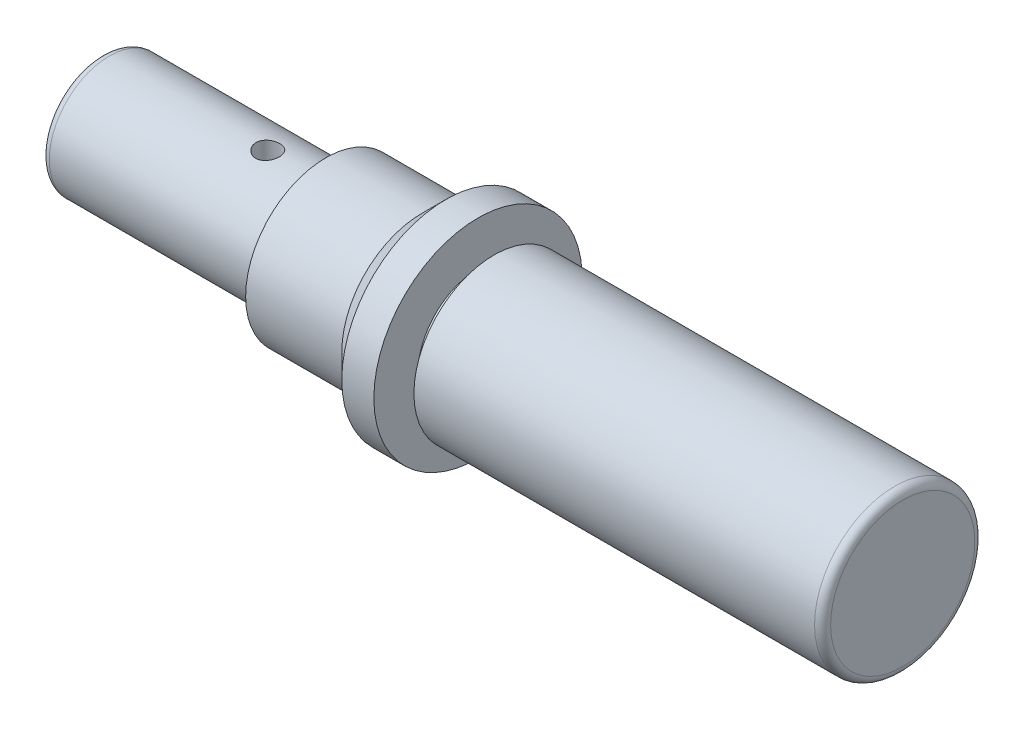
ISO-10303-21;
HEADER;
FILE_DESCRIPTION(('STEP AP214'),'2;1');
FILE_NAME('part.step','',(''),(''),'','','');
FILE_SCHEMA(('AUTOMOTIVE_DESIGN { 1 0 10303 214 1 1 1 1 }'));
ENDSEC;
DATA;
#1=APPLICATION_CONTEXT('core data for automotive mechanical design processes');
#2=APPLICATION_PROTOCOL_DEFINITION('international standard','automotive_design',2000,#1);
#3=PRODUCT_CONTEXT('',#1,'mechanical');
#4=PRODUCT('Part','Part','',(#3));
#5=PRODUCT_RELATED_PRODUCT_CATEGORY('part','',(#4));
#6=PRODUCT_DEFINITION_FORMATION('','',#4);
#7=PRODUCT_DEFINITION_CONTEXT('part definition',#1,'design');
#8=PRODUCT_DEFINITION('design','',#6,#7);
#9=PRODUCT_DEFINITION_SHAPE('','',#8);
#10=(LENGTH_UNIT() NAMED_UNIT(*) SI_UNIT(.MILLI.,.METRE.));
#11=(NAMED_UNIT(*) PLANE_ANGLE_UNIT() SI_UNIT($,.RADIAN.));
#12=(NAMED_UNIT(*) SI_UNIT($,.STERADIAN.) SOLID_ANGLE_UNIT());
#13=UNCERTAINTY_MEASURE_WITH_UNIT(LENGTH_MEASURE(1.E-05),#10,'distance_accuracy_value','');
#14=(GEOMETRIC_REPRESENTATION_CONTEXT(3) GLOBAL_UNCERTAINTY_ASSIGNED_CONTEXT((#13)) GLOBAL_UNIT_ASSIGNED_CONTEXT((#10,
#11,#12)) REPRESENTATION_CONTEXT('',''));
#15=CARTESIAN_POINT('',(0.,0.,0.));
#16=DIRECTION('',(0.,0.,1.));
#17=DIRECTION('',(1.,0.,0.));
#18=AXIS2_PLACEMENT_3D('',#15,#16,#17);
#19=CARTESIAN_POINT('',(-61.6997640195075,9.89779965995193,0.));
#20=DIRECTION('',(1.,0.,0.));
#21=DIRECTION('',(0.,0.,-1.));
#22=AXIS2_PLACEMENT_3D('',#19,#20,#21);
#23=PLANE('',#22);
#24=CARTESIAN_POINT('',(-61.6997640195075,9.89779965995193,0.));
#25=DIRECTION('',(1.,0.,0.));
#26=DIRECTION('',(0.,0.,-1.));
#27=AXIS2_PLACEMENT_3D('',#24,#25,#26);
#28=CIRCLE('',#27,6.5);
#29=CARTESIAN_POINT('',(-61.6997640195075,9.89779965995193,-6.5));
#30=VERTEX_POINT('',#29);
#31=EDGE_CURVE('E59',#30,#30,#28,.F.);
#32=ORIENTED_EDGE('',*,*,#31,.T.);
#33=EDGE_LOOP('',(#32));
#34=FACE_BOUND('',#33,.T.);
#35=ADVANCED_FACE('F40',(#34),#23,.F.);
#36=CARTESIAN_POINT('',(-61.6997640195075,9.89779965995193,0.));
#37=DIRECTION('',(-1.,0.,0.));
#38=DIRECTION('',(0.,0.,1.));
#39=AXIS2_PLACEMENT_3D('',#36,#37,#38);
#40=CYLINDRICAL_SURFACE('',#39,7.5);
#41=CARTESIAN_POINT('',(-40.6997640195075,2.50584884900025,1.26848855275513));
#42=CARTESIAN_POINT('',(-40.6164174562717,2.50584728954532,1.26848542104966));
#43=CARTESIAN_POINT('',(-40.5330320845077,2.50463505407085,1.26147673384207));
#44=CARTESIAN_POINT('',(-40.3686202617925,2.49994263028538,1.23365431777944));
#45=CARTESIAN_POINT('',(-40.2875957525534,2.49646062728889,1.21282954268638));
#46=CARTESIAN_POINT('',(-40.1303080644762,2.48769399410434,1.15805762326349));
#47=CARTESIAN_POINT('',(-40.0540402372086,2.48241115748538,1.12412353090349));
#48=CARTESIAN_POINT('',(-39.908251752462,2.47072894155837,1.04414865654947));
#49=CARTESIAN_POINT('',(-39.8387307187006,2.46432962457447,0.998108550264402));
#50=CARTESIAN_POINT('',(-39.7074225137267,2.45115462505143,0.894555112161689));
#51=CARTESIAN_POINT('',(-39.6457446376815,2.44437519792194,0.836903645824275));
#52=CARTESIAN_POINT('',(-39.532827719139,2.43141754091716,0.712086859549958));
#53=CARTESIAN_POINT('',(-39.4815894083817,2.42523935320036,0.644920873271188));
#54=CARTESIAN_POINT('',(-39.3905819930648,2.4142930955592,0.502277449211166));
#55=CARTESIAN_POINT('',(-39.3509167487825,2.40953778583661,0.426732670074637));
#56=CARTESIAN_POINT('',(-39.2848516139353,2.40224910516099,0.269948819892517));
#57=CARTESIAN_POINT('',(-39.258450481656,2.39971552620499,0.188710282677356));
#58=CARTESIAN_POINT('',(-39.220003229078,2.39739192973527,0.0239939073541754));
#59=CARTESIAN_POINT('',(-39.207772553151,2.39756620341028,-0.0594403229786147));
#60=CARTESIAN_POINT('',(-39.19743759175,2.40077061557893,-0.227121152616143));
#61=CARTESIAN_POINT('',(-39.1993319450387,2.40380047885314,-0.311367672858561));
#62=CARTESIAN_POINT('',(-39.2170532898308,2.41253141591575,-0.477015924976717));
#63=CARTESIAN_POINT('',(-39.2326814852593,2.41819383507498,-0.558441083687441));
#64=CARTESIAN_POINT('',(-39.2771115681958,2.43176426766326,-0.717414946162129));
#65=CARTESIAN_POINT('',(-39.3059139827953,2.43967237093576,-0.794963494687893));
#66=CARTESIAN_POINT('',(-39.3760590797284,2.45713333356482,-0.944562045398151));
#67=CARTESIAN_POINT('',(-39.4174796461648,2.46669624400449,-1.01657431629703));
#68=CARTESIAN_POINT('',(-39.5116276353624,2.48658563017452,-1.15266814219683));
#69=CARTESIAN_POINT('',(-39.5643563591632,2.49691219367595,-1.21674878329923));
#70=CARTESIAN_POINT('',(-39.6807144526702,2.51756201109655,-1.33635553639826));
#71=CARTESIAN_POINT('',(-39.7445177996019,2.52788207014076,-1.39171307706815));
#72=CARTESIAN_POINT('',(-39.8806386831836,2.54732397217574,-1.49099775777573));
#73=CARTESIAN_POINT('',(-39.9529563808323,2.556445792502,-1.53492468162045));
#74=CARTESIAN_POINT('',(-40.1042952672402,2.57258208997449,-1.61017981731));
#75=CARTESIAN_POINT('',(-40.183330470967,2.57959201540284,-1.64148086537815));
#76=CARTESIAN_POINT('',(-40.3457210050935,2.5907335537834,-1.6903906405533));
#77=CARTESIAN_POINT('',(-40.4290757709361,2.5948655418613,-1.70800115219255));
#78=CARTESIAN_POINT('',(-40.596211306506,2.59975884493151,-1.72878964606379));
#79=CARTESIAN_POINT('',(-40.679960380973,2.60057662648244,-1.73220943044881));
#80=CARTESIAN_POINT('',(-40.846836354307,2.59890971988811,-1.72517196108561));
#81=CARTESIAN_POINT('',(-40.9299632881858,2.59642521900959,-1.71471549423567));
#82=CARTESIAN_POINT('',(-41.0924169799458,2.58845812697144,-1.68042498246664));
#83=CARTESIAN_POINT('',(-41.1717725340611,2.58300451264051,-1.65672017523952));
#84=CARTESIAN_POINT('',(-41.3253589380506,2.56967670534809,-1.59673175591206));
#85=CARTESIAN_POINT('',(-41.399589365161,2.56180231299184,-1.56044710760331));
#86=CARTESIAN_POINT('',(-41.5418836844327,2.54429655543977,-1.4757637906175));
#87=CARTESIAN_POINT('',(-41.6098545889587,2.53464362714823,-1.42721338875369));
#88=CARTESIAN_POINT('',(-41.7367264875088,2.51459160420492,-1.31955674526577));
#89=CARTESIAN_POINT('',(-41.7956265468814,2.50419243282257,-1.26044941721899));
#90=CARTESIAN_POINT('',(-41.9036078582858,2.4834696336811,-1.13224676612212));
#91=CARTESIAN_POINT('',(-41.9525245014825,2.47314961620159,-1.06301204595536));
#92=CARTESIAN_POINT('',(-42.0379828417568,2.45372264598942,-0.917128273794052));
#93=CARTESIAN_POINT('',(-42.0745250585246,2.44461564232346,-0.840479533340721));
#94=CARTESIAN_POINT('',(-42.1339573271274,2.42848494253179,-0.682357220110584));
#95=CARTESIAN_POINT('',(-42.1569247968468,2.42144954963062,-0.600913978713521));
#96=CARTESIAN_POINT('',(-42.1888008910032,2.40997327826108,-0.435146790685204));
#97=CARTESIAN_POINT('',(-42.197711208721,2.40553208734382,-0.350823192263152));
#98=CARTESIAN_POINT('',(-42.2011544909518,2.39957817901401,-0.183255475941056));
#99=CARTESIAN_POINT('',(-42.1959349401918,2.39801584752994,-0.100018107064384));
#100=CARTESIAN_POINT('',(-42.1718130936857,2.39762563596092,0.0644525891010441));
#101=CARTESIAN_POINT('',(-42.1529109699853,2.39879772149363,0.145685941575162));
#102=CARTESIAN_POINT('',(-42.10207053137,2.40353406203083,0.303678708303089));
#103=CARTESIAN_POINT('',(-42.0701619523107,2.4070928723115,0.380447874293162));
#104=CARTESIAN_POINT('',(-41.9942456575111,2.4160187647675,0.527633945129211));
#105=CARTESIAN_POINT('',(-41.9502369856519,2.4213859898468,0.598050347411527));
#106=CARTESIAN_POINT('',(-41.8505349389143,2.43327434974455,0.731740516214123));
#107=CARTESIAN_POINT('',(-41.7946645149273,2.43981270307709,0.794880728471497));
#108=CARTESIAN_POINT('',(-41.6731886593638,2.45310094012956,0.910979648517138));
#109=CARTESIAN_POINT('',(-41.6075809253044,2.45985087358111,0.963935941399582));
#110=CARTESIAN_POINT('',(-41.4676450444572,2.47274032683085,1.05868365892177));
#111=CARTESIAN_POINT('',(-41.3932305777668,2.47887248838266,1.10034867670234));
#112=CARTESIAN_POINT('',(-41.2383648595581,2.48960980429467,1.17046630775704));
#113=CARTESIAN_POINT('',(-41.1579191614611,2.49421634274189,1.19893090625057));
#114=CARTESIAN_POINT('',(-41.0143703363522,2.50038086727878,1.23630467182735));
#115=CARTESIAN_POINT('',(-40.952085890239,2.50241698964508,1.24835169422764));
#116=CARTESIAN_POINT('',(-40.8264630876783,2.50515155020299,1.26444468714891));
#117=CARTESIAN_POINT('',(-40.76312476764,2.50585003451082,1.26849093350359));
#118=CARTESIAN_POINT('',(-40.6997640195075,2.50584884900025,1.26848855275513));
#119=B_SPLINE_CURVE_WITH_KNOTS('',3,(#41,#42,#43,#44,#45,#46,#47,#48,#49,#50,#51,#52,#53,#54,
#55,#56,#57,#58,#59,#60,#61,#62,#63,#64,#65,#66,#67,#68,#69,#70,#71,#72,#73,#74,#75,#76,#77,#78,
#79,#80,#81,#82,#83,#84,#85,#86,#87,#88,#89,#90,#91,#92,#93,#94,#95,#96,#97,#98,#99,#100,#101,
#102,#103,#104,#105,#106,#107,#108,#109,#110,#111,#112,#113,#114,#115,#116,#117,#118),
.UNSPECIFIED.,.T.,.F.,(4,2,2,2,2,2,2,2,2,2,2,2,2,2,2,2,2,2,2,2,2,2,2,2,2,2,2,2,2,2,2,2,2,2,2,2,
2,2,4),(0.,0.249807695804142,0.499815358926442,0.749574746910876,0.999320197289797,
1.25223378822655,1.50516510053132,1.76030100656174,2.01541302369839,2.26716373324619,
2.51889018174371,2.76703184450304,3.01518343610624,3.26489886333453,3.51464303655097,
3.76874020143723,4.02284217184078,4.27748794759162,4.53210052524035,4.78235636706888,
5.0325980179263,5.28044012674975,5.52830265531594,5.77939589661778,6.03051499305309,
6.28548902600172,6.54045234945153,6.79394720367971,7.04741152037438,7.29646526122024,
7.5455158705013,7.79400025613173,8.04250428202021,8.2950172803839,8.54759008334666,
8.80288347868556,9.05794462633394,9.24785705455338,9.43776293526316),.UNSPECIFIED.);
#120=CARTESIAN_POINT('',(-40.6997640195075,2.50584884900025,1.26848855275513));
#121=VERTEX_POINT('',#120);
#122=EDGE_CURVE('E44',#121,#121,#119,.T.);
#123=ORIENTED_EDGE('',*,*,#122,.T.);
#124=EDGE_LOOP('',(#123));
#125=FACE_BOUND('',#124,.T.);
#126=CARTESIAN_POINT('',(-40.6997640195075,17.1955383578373,1.73003176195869));
#127=CARTESIAN_POINT('',(-40.7831105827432,17.1955401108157,1.73002873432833));
#128=CARTESIAN_POINT('',(-40.8664959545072,17.1971899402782,1.72310997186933));
#129=CARTESIAN_POINT('',(-41.0309077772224,17.2036197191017,1.69563701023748));
#130=CARTESIAN_POINT('',(-41.1119322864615,17.2084021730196,1.67507190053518));
#131=CARTESIAN_POINT('',(-41.2692199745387,17.220589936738,1.62095835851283));
#132=CARTESIAN_POINT('',(-41.3454878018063,17.2279926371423,1.58742283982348));
#133=CARTESIAN_POINT('',(-41.4912762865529,17.2446724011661,1.50833908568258));
#134=CARTESIAN_POINT('',(-41.5607973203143,17.2539493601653,1.46279152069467));
#135=CARTESIAN_POINT('',(-41.6921055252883,17.2735991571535,1.36026942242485));
#136=CARTESIAN_POINT('',(-41.7537834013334,17.283984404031,1.30315726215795));
#137=CARTESIAN_POINT('',(-41.8667003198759,17.3047521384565,1.17940011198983));
#138=CARTESIAN_POINT('',(-41.9179386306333,17.3151346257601,1.11275445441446));
#139=CARTESIAN_POINT('',(-42.0089460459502,17.3350140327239,0.971079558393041));
#140=CARTESIAN_POINT('',(-42.0486112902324,17.3445024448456,0.895982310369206));
#141=CARTESIAN_POINT('',(-42.1146764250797,17.3616191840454,0.739965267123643));
#142=CARTESIAN_POINT('',(-42.1410775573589,17.3692476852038,0.659046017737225));
#143=CARTESIAN_POINT('',(-42.1795248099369,17.3819071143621,0.494800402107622));
#144=CARTESIAN_POINT('',(-42.191755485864,17.3869709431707,0.411519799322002));
#145=CARTESIAN_POINT('',(-42.2020904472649,17.39429936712,0.243968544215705));
#146=CARTESIAN_POINT('',(-42.2001960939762,17.3965642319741,0.159697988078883));
#147=CARTESIAN_POINT('',(-42.1824747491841,17.3982494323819,-0.00617163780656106));
#148=CARTESIAN_POINT('',(-42.1668465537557,17.3977098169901,-0.0877916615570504));
#149=CARTESIAN_POINT('',(-42.1224164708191,17.394146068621,-0.247303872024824));
#150=CARTESIAN_POINT('',(-42.0936140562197,17.391121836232,-0.325195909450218));
#151=CARTESIAN_POINT('',(-42.0234689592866,17.3830866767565,-0.475595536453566));
#152=CARTESIAN_POINT('',(-41.9820483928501,17.3780633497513,-0.548066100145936));
#153=CARTESIAN_POINT('',(-41.8879004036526,17.3667567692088,-0.685140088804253));
#154=CARTESIAN_POINT('',(-41.8351716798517,17.3604733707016,-0.749742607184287));
#155=CARTESIAN_POINT('',(-41.7188135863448,17.347372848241,-0.870409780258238));
#156=CARTESIAN_POINT('',(-41.6550102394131,17.3405483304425,-0.926305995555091));
#157=CARTESIAN_POINT('',(-41.5188893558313,17.3273775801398,-1.02661535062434));
#158=CARTESIAN_POINT('',(-41.4465716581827,17.3210313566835,-1.07102827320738));
#159=CARTESIAN_POINT('',(-41.2952327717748,17.309651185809,-1.14714796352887));
#160=CARTESIAN_POINT('',(-41.216197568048,17.3046200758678,-1.1788273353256));
#161=CARTESIAN_POINT('',(-41.0538070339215,17.2965709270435,-1.22834007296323));
#162=CARTESIAN_POINT('',(-40.9704522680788,17.2935526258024,-1.24617524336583));
#163=CARTESIAN_POINT('',(-40.8033167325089,17.289974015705,-1.26722992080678));
#164=CARTESIAN_POINT('',(-40.719567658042,17.2893725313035,-1.27069429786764));
#165=CARTESIAN_POINT('',(-40.5526916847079,17.2905943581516,-1.26356606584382));
#166=CARTESIAN_POINT('',(-40.4695647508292,17.292417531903,-1.25297425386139));
#167=CARTESIAN_POINT('',(-40.3071110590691,17.2982162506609,-1.21825122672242));
#168=CARTESIAN_POINT('',(-40.2277555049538,17.3021709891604,-1.19425081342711));
#169=CARTESIAN_POINT('',(-40.0741691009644,17.3117066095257,-1.13354403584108));
#170=CARTESIAN_POINT('',(-39.9999386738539,17.3172876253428,-1.09683662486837));
#171=CARTESIAN_POINT('',(-39.8576443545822,17.3294426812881,-1.01122137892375));
#172=CARTESIAN_POINT('',(-39.7896734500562,17.3360287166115,-0.962160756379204));
#173=CARTESIAN_POINT('',(-39.6628015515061,17.3492828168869,-0.853457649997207));
#174=CARTESIAN_POINT('',(-39.6039014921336,17.3559508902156,-0.793814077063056));
#175=CARTESIAN_POINT('',(-39.4959201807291,17.3685846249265,-0.664563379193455));
#176=CARTESIAN_POINT('',(-39.4470035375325,17.3745379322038,-0.594817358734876));
#177=CARTESIAN_POINT('',(-39.3615451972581,17.3847684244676,-0.448001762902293));
#178=CARTESIAN_POINT('',(-39.3250029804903,17.3890456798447,-0.370932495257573));
#179=CARTESIAN_POINT('',(-39.2655707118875,17.3952181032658,-0.212109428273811));
#180=CARTESIAN_POINT('',(-39.2426032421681,17.3971268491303,-0.130385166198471));
#181=CARTESIAN_POINT('',(-39.2107271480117,17.3981741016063,0.0357755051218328));
#182=CARTESIAN_POINT('',(-39.201816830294,17.39731294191,0.120211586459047));
#183=CARTESIAN_POINT('',(-39.1983735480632,17.3927356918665,0.287822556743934));
#184=CARTESIAN_POINT('',(-39.2035930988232,17.3890695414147,0.370993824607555));
#185=CARTESIAN_POINT('',(-39.2277149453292,17.3791339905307,0.535164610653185));
#186=CARTESIAN_POINT('',(-39.2466170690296,17.3728646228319,0.616164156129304));
#187=CARTESIAN_POINT('',(-39.2974575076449,17.3582192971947,0.773547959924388));
#188=CARTESIAN_POINT('',(-39.3293660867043,17.3498481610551,0.849942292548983));
#189=CARTESIAN_POINT('',(-39.4052823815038,17.3316999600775,0.996277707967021));
#190=CARTESIAN_POINT('',(-39.4492910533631,17.321922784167,1.06621828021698));
#191=CARTESIAN_POINT('',(-39.5489931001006,17.3016651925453,1.19889843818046));
#192=CARTESIAN_POINT('',(-39.6048635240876,17.2911759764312,1.26150365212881));
#193=CARTESIAN_POINT('',(-39.7263393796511,17.2706255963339,1.37653937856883));
#194=CARTESIAN_POINT('',(-39.7919471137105,17.260564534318,1.4289674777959));
#195=CARTESIAN_POINT('',(-39.9318829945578,17.2417525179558,1.52271914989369));
#196=CARTESIAN_POINT('',(-40.0062974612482,17.2330168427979,1.56391702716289));
#197=CARTESIAN_POINT('',(-40.1611631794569,17.217898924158,1.63322229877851));
#198=CARTESIAN_POINT('',(-40.2416088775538,17.2115145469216,1.66134156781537));
#199=CARTESIAN_POINT('',(-40.3851577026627,17.2030159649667,1.69825462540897));
#200=CARTESIAN_POINT('',(-40.447442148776,17.2002275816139,1.71015006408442));
#201=CARTESIAN_POINT('',(-40.5730649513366,17.1964881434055,1.72603964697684));
#202=CARTESIAN_POINT('',(-40.6364032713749,17.1955370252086,1.73003406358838));
#203=CARTESIAN_POINT('',(-40.6997640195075,17.1955383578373,1.73003176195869));
#204=B_SPLINE_CURVE_WITH_KNOTS('',3,(#126,#127,#128,#129,#130,#131,#132,#133,#134,#135,#136,
#137,#138,#139,#140,#141,#142,#143,#144,#145,#146,#147,#148,#149,#150,#151,#152,#153,#154,#155,
#156,#157,#158,#159,#160,#161,#162,#163,#164,#165,#166,#167,#168,#169,#170,#171,#172,#173,#174,
#175,#176,#177,#178,#179,#180,#181,#182,#183,#184,#185,#186,#187,#188,#189,#190,#191,#192,#193,
#194,#195,#196,#197,#198,#199,#200,#201,#202,#203),.UNSPECIFIED.,.T.,.F.,(4,2,2,2,2,2,2,2,2,2,2,
2,2,2,2,2,2,2,2,2,2,2,2,2,2,2,2,2,2,2,2,2,2,2,2,2,2,2,4),(0.,0.249807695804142,
0.499815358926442,0.749574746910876,0.999320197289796,1.25223378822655,1.50516510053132,
1.76030100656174,2.01541302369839,2.26716373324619,2.51889018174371,2.76703184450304,
3.01518343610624,3.26489886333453,3.51464303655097,3.76874020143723,4.02284217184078,
4.27748794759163,4.53210052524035,4.78235636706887,5.0325980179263,5.28044012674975,
5.52830265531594,5.77939589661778,6.03051499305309,6.28548902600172,6.54045234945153,
6.79394720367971,7.04741152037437,7.29646526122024,7.5455158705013,7.79400025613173,
8.04250428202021,8.29501728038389,8.54759008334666,8.80288347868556,9.05794462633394,
9.24785705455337,9.43776293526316),.UNSPECIFIED.);
#205=CARTESIAN_POINT('',(-40.6997640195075,17.1955383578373,1.73003176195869));
#206=VERTEX_POINT('',#205);
#207=EDGE_CURVE('E10',#206,#206,#204,.T.);
#208=ORIENTED_EDGE('',*,*,#207,.T.);
#209=EDGE_LOOP('',(#208));
#210=FACE_BOUND('',#209,.T.);
#211=CARTESIAN_POINT('',(-60.6997640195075,9.89779965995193,0.));
#212=DIRECTION('',(1.,0.,0.));
#213=DIRECTION('',(0.,0.,-1.));
#214=AXIS2_PLACEMENT_3D('',#211,#212,#213);
#215=CIRCLE('',#214,7.5);
#216=CARTESIAN_POINT('',(-60.6997640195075,9.89779965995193,-7.5));
#217=VERTEX_POINT('',#216);
#218=EDGE_CURVE('E54',#217,#217,#215,.T.);
#219=ORIENTED_EDGE('',*,*,#218,.T.);
#220=EDGE_LOOP('',(#219));
#221=FACE_BOUND('',#220,.T.);
#222=CARTESIAN_POINT('',(-33.6997640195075,9.89779965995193,0.));
#223=DIRECTION('',(-1.,0.,0.));
#224=DIRECTION('',(0.,0.,1.));
#225=AXIS2_PLACEMENT_3D('',#222,#223,#224);
#226=CIRCLE('',#225,7.5);
#227=CARTESIAN_POINT('',(-33.6997640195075,9.89779965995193,7.5));
#228=VERTEX_POINT('',#227);
#229=EDGE_CURVE('E136',#228,#228,#226,.T.);
#230=ORIENTED_EDGE('',*,*,#229,.T.);
#231=EDGE_LOOP('',(#230));
#232=FACE_BOUND('',#231,.T.);
#233=ADVANCED_FACE('F65',(#125,#210,#221,#232),#40,.T.);
#234=CARTESIAN_POINT('',(-33.6997640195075,17.3977996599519,0.));
#235=DIRECTION('',(1.,0.,0.));
#236=DIRECTION('',(0.,0.,-1.));
#237=AXIS2_PLACEMENT_3D('',#234,#235,#236);
#238=PLANE('',#237);
#239=ORIENTED_EDGE('',*,*,#229,.F.);
#240=EDGE_LOOP('',(#239));
#241=FACE_BOUND('',#240,.T.);
#242=CARTESIAN_POINT('',(-33.6997640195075,9.89779965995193,0.));
#243=DIRECTION('',(-1.,0.,0.));
#244=DIRECTION('',(0.,0.,1.));
#245=AXIS2_PLACEMENT_3D('',#242,#243,#244);
#246=CIRCLE('',#245,10.);
#247=CARTESIAN_POINT('',(-33.6997640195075,9.89779965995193,10.));
#248=VERTEX_POINT('',#247);
#249=EDGE_CURVE('E142',#248,#248,#246,.T.);
#250=ORIENTED_EDGE('',*,*,#249,.T.);
#251=EDGE_LOOP('',(#250));
#252=FACE_BOUND('',#251,.T.);
#253=ADVANCED_FACE('F106',(#241,#252),#238,.F.);
#254=CARTESIAN_POINT('',(-61.6997640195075,9.89779965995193,0.));
#255=DIRECTION('',(-1.,0.,0.));
#256=DIRECTION('',(0.,0.,1.));
#257=AXIS2_PLACEMENT_3D('',#254,#255,#256);
#258=CYLINDRICAL_SURFACE('',#257,10.);
#259=ORIENTED_EDGE('',*,*,#249,.F.);
#260=EDGE_LOOP('',(#259));
#261=FACE_BOUND('',#260,.T.);
#262=CARTESIAN_POINT('',(-21.6997640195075,9.89779965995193,0.));
#263=DIRECTION('',(-1.,0.,0.));
#264=DIRECTION('',(0.,0.,1.));
#265=AXIS2_PLACEMENT_3D('',#262,#263,#264);
#266=CIRCLE('',#265,10.);
#267=CARTESIAN_POINT('',(-21.6997640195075,9.89779965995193,10.));
#268=VERTEX_POINT('',#267);
#269=EDGE_CURVE('E151',#268,#268,#266,.T.);
#270=ORIENTED_EDGE('',*,*,#269,.T.);
#271=EDGE_LOOP('',(#270));
#272=FACE_BOUND('',#271,.T.);
#273=ADVANCED_FACE('F103',(#261,#272),#258,.T.);
#274=CARTESIAN_POINT('',(-18.6997640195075,9.89779965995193,0.));
#275=DIRECTION('',(1.,0.,0.));
#276=DIRECTION('',(0.,0.,-1.));
#277=AXIS2_PLACEMENT_3D('',#274,#275,#276);
#278=CONICAL_SURFACE('',#277,13.,0.78539816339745);
#279=ORIENTED_EDGE('',*,*,#269,.F.);
#280=EDGE_LOOP('',(#279));
#281=FACE_BOUND('',#280,.T.);
#282=CARTESIAN_POINT('',(-18.6997640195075,9.89779965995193,0.));
#283=DIRECTION('',(-1.,0.,0.));
#284=DIRECTION('',(0.,0.,1.));
#285=AXIS2_PLACEMENT_3D('',#282,#283,#284);
#286=CIRCLE('',#285,13.);
#287=CARTESIAN_POINT('',(-18.6997640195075,9.89779965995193,13.));
#288=VERTEX_POINT('',#287);
#289=EDGE_CURVE('E155',#288,#288,#286,.T.);
#290=ORIENTED_EDGE('',*,*,#289,.T.);
#291=EDGE_LOOP('',(#290));
#292=FACE_BOUND('',#291,.T.);
#293=ADVANCED_FACE('F99',(#281,#292),#278,.T.);
#294=CARTESIAN_POINT('',(-61.6997640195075,9.89779965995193,0.));
#295=DIRECTION('',(-1.,0.,0.));
#296=DIRECTION('',(0.,0.,1.));
#297=AXIS2_PLACEMENT_3D('',#294,#295,#296);
#298=CYLINDRICAL_SURFACE('',#297,13.);
#299=ORIENTED_EDGE('',*,*,#289,.F.);
#300=EDGE_LOOP('',(#299));
#301=FACE_BOUND('',#300,.T.);
#302=CARTESIAN_POINT('',(-14.6997640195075,9.89779965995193,0.));
#303=DIRECTION('',(-1.,0.,0.));
#304=DIRECTION('',(0.,0.,1.));
#305=AXIS2_PLACEMENT_3D('',#302,#303,#304);
#306=CIRCLE('',#305,13.);
#307=CARTESIAN_POINT('',(-14.6997640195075,9.89779965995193,13.));
#308=VERTEX_POINT('',#307);
#309=EDGE_CURVE('E159',#308,#308,#306,.T.);
#310=ORIENTED_EDGE('',*,*,#309,.T.);
#311=EDGE_LOOP('',(#310));
#312=FACE_BOUND('',#311,.T.);
#313=ADVANCED_FACE('F95',(#301,#312),#298,.T.);
#314=CARTESIAN_POINT('',(-14.6997640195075,22.8977996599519,0.));
#315=DIRECTION('',(-1.,0.,0.));
#316=DIRECTION('',(0.,0.,1.));
#317=AXIS2_PLACEMENT_3D('',#314,#315,#316);
#318=PLANE('',#317);
#319=ORIENTED_EDGE('',*,*,#309,.F.);
#320=EDGE_LOOP('',(#319));
#321=FACE_BOUND('',#320,.T.);
#322=CARTESIAN_POINT('',(-14.6997640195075,9.89779965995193,0.));
#323=DIRECTION('',(-1.,0.,0.));
#324=DIRECTION('',(0.,0.,1.));
#325=AXIS2_PLACEMENT_3D('',#322,#323,#324);
#326=CIRCLE('',#325,7.5);
#327=CARTESIAN_POINT('',(-14.6997640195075,9.89779965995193,7.5));
#328=VERTEX_POINT('',#327);
#329=EDGE_CURVE('E163',#328,#328,#326,.T.);
#330=ORIENTED_EDGE('',*,*,#329,.T.);
#331=EDGE_LOOP('',(#330));
#332=FACE_BOUND('',#331,.T.);
#333=ADVANCED_FACE('F91',(#321,#332),#318,.F.);
#334=CARTESIAN_POINT('',(-61.6997640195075,9.89779965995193,0.));
#335=DIRECTION('',(-1.,0.,0.));
#336=DIRECTION('',(0.,0.,1.));
#337=AXIS2_PLACEMENT_3D('',#334,#335,#336);
#338=CYLINDRICAL_SURFACE('',#337,7.5);
#339=ORIENTED_EDGE('',*,*,#329,.F.);
#340=EDGE_LOOP('',(#339));
#341=FACE_BOUND('',#340,.T.);
#342=CARTESIAN_POINT('',(-12.6997640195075,9.89779965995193,0.));
#343=DIRECTION('',(-1.,0.,0.));
#344=DIRECTION('',(0.,0.,1.));
#345=AXIS2_PLACEMENT_3D('',#342,#343,#344);
#346=CIRCLE('',#345,7.5);
#347=CARTESIAN_POINT('',(-12.6997640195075,9.89779965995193,7.5));
#348=VERTEX_POINT('',#347);
#349=EDGE_CURVE('E167',#348,#348,#346,.T.);
#350=ORIENTED_EDGE('',*,*,#349,.T.);
#351=EDGE_LOOP('',(#350));
#352=FACE_BOUND('',#351,.T.);
#353=ADVANCED_FACE('F87',(#341,#352),#338,.T.);
#354=CARTESIAN_POINT('',(-12.6997640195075,17.3977996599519,0.));
#355=DIRECTION('',(1.,0.,0.));
#356=DIRECTION('',(0.,0.,-1.));
#357=AXIS2_PLACEMENT_3D('',#354,#355,#356);
#358=PLANE('',#357);
#359=ORIENTED_EDGE('',*,*,#349,.F.);
#360=EDGE_LOOP('',(#359));
#361=FACE_BOUND('',#360,.T.);
#362=CARTESIAN_POINT('',(-12.6997640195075,9.89779965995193,0.));
#363=DIRECTION('',(-1.,0.,0.));
#364=DIRECTION('',(0.,0.,1.));
#365=AXIS2_PLACEMENT_3D('',#362,#363,#364);
#366=CIRCLE('',#365,10.);
#367=CARTESIAN_POINT('',(-12.6997640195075,9.89779965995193,10.));
#368=VERTEX_POINT('',#367);
#369=EDGE_CURVE('E171',#368,#368,#366,.T.);
#370=ORIENTED_EDGE('',*,*,#369,.T.);
#371=EDGE_LOOP('',(#370));
#372=FACE_BOUND('',#371,.T.);
#373=ADVANCED_FACE('F83',(#361,#372),#358,.F.);
#374=CARTESIAN_POINT('',(-61.6997640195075,9.89779965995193,0.));
#375=DIRECTION('',(-1.,0.,0.));
#376=DIRECTION('',(0.,0.,1.));
#377=AXIS2_PLACEMENT_3D('',#374,#375,#376);
#378=CYLINDRICAL_SURFACE('',#377,10.);
#379=CARTESIAN_POINT('',(37.3002359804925,9.89779965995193,0.));
#380=DIRECTION('',(-1.,0.,0.));
#381=DIRECTION('',(0.,0.,1.));
#382=AXIS2_PLACEMENT_3D('',#379,#380,#381);
#383=CIRCLE('',#382,10.);
#384=CARTESIAN_POINT('',(37.3002359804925,9.89779965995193,10.));
#385=VERTEX_POINT('',#384);
#386=EDGE_CURVE('E134',#385,#385,#383,.T.);
#387=ORIENTED_EDGE('',*,*,#386,.T.);
#388=EDGE_LOOP('',(#387));
#389=FACE_BOUND('',#388,.T.);
#390=ORIENTED_EDGE('',*,*,#369,.F.);
#391=EDGE_LOOP('',(#390));
#392=FACE_BOUND('',#391,.T.);
#393=ADVANCED_FACE('F79',(#389,#392),#378,.T.);
#394=CARTESIAN_POINT('',(38.3002359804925,19.8977996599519,0.));
#395=DIRECTION('',(-1.,0.,0.));
#396=DIRECTION('',(0.,0.,1.));
#397=AXIS2_PLACEMENT_3D('',#394,#395,#396);
#398=PLANE('',#397);
#399=CARTESIAN_POINT('',(38.3002359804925,9.89779965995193,0.));
#400=DIRECTION('',(-1.,0.,0.));
#401=DIRECTION('',(0.,0.,1.));
#402=AXIS2_PLACEMENT_3D('',#399,#400,#401);
#403=CIRCLE('',#402,9.);
#404=CARTESIAN_POINT('',(38.3002359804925,9.89779965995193,9.));
#405=VERTEX_POINT('',#404);
#406=EDGE_CURVE('E131',#405,#405,#403,.F.);
#407=ORIENTED_EDGE('',*,*,#406,.T.);
#408=EDGE_LOOP('',(#407));
#409=FACE_BOUND('',#408,.T.);
#410=ADVANCED_FACE('F74',(#409),#398,.F.);
#411=CARTESIAN_POINT('',(37.3002359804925,9.89779965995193,0.));
#412=DIRECTION('',(-1.,0.,0.));
#413=DIRECTION('',(0.,0.,1.));
#414=AXIS2_PLACEMENT_3D('',#411,#412,#413);
#415=TOROIDAL_SURFACE('',#414,9.,1.);
#416=ORIENTED_EDGE('',*,*,#406,.F.);
#417=EDGE_LOOP('',(#416));
#418=FACE_BOUND('',#417,.T.);
#419=ORIENTED_EDGE('',*,*,#386,.F.);
#420=EDGE_LOOP('',(#419));
#421=FACE_BOUND('',#420,.T.);
#422=ADVANCED_FACE('F78',(#418,#421),#415,.T.);
#423=CARTESIAN_POINT('',(-60.6997640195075,9.89779965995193,0.));
#424=DIRECTION('',(1.,0.,0.));
#425=DIRECTION('',(0.,0.,-1.));
#426=AXIS2_PLACEMENT_3D('',#423,#424,#425);
#427=TOROIDAL_SURFACE('',#426,6.5,1.);
#428=ORIENTED_EDGE('',*,*,#218,.F.);
#429=EDGE_LOOP('',(#428));
#430=FACE_BOUND('',#429,.T.);
#431=ORIENTED_EDGE('',*,*,#31,.F.);
#432=EDGE_LOOP('',(#431));
#433=FACE_BOUND('',#432,.T.);
#434=ADVANCED_FACE('F42',(#430,#433),#427,.T.);
#435=CARTESIAN_POINT('',(-40.6997640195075,17.3941004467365,0.235530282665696));
#436=DIRECTION('',(0.,0.99950677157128,0.0314040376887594));
#437=DIRECTION('',(0.,-0.0314040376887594,0.99950677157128));
#438=AXIS2_PLACEMENT_3D('',#435,#436,#437);
#439=CYLINDRICAL_SURFACE('',#438,1.49999999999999);
#440=ORIENTED_EDGE('',*,*,#207,.F.);
#441=EDGE_LOOP('',(#440));
#442=FACE_BOUND('',#441,.T.);
#443=ORIENTED_EDGE('',*,*,#122,.F.);
#444=EDGE_LOOP('',(#443));
#445=FACE_BOUND('',#444,.T.);
#446=ADVANCED_FACE('F69',(#442,#445),#439,.F.);
#447=CLOSED_SHELL('',(#35,#233,#253,#273,#293,#313,#333,#353,#373,#393,#410,#422,#434,#446));
#448=MANIFOLD_SOLID_BREP('B2',#447);
#449=ADVANCED_BREP_SHAPE_REPRESENTATION('',(#18,#448),#14);
#450=SHAPE_DEFINITION_REPRESENTATION(#9,#449);
ENDSEC;
END-ISO-10303-21;
